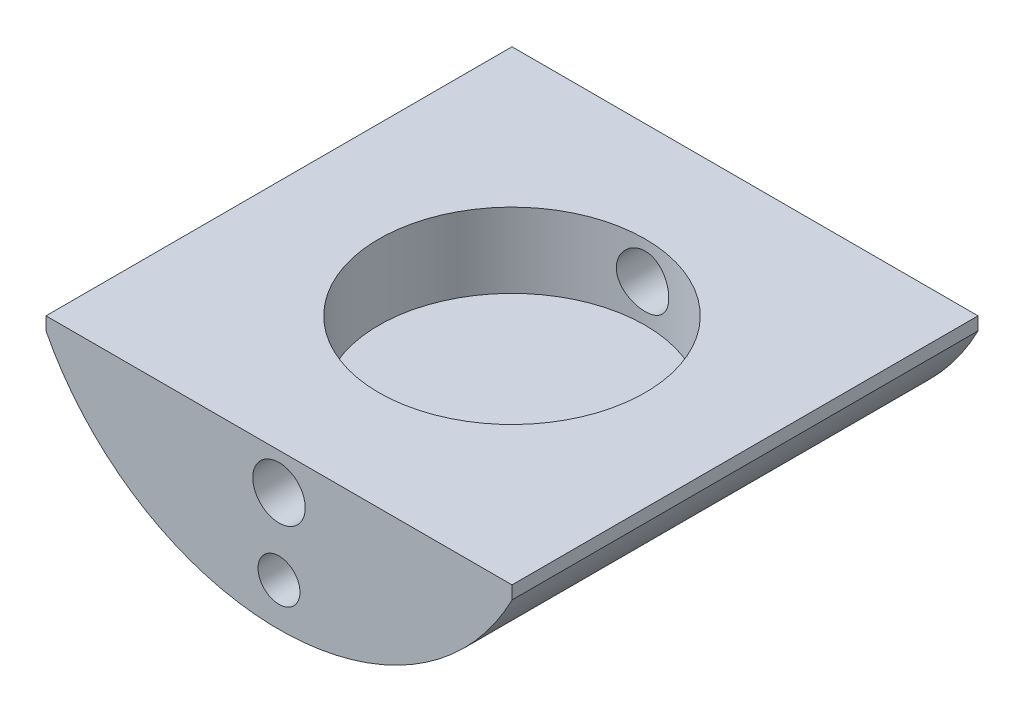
from build123d import *

# Parameters (mm, degrees)
BOSS_EXTRUDE1_DEPTH          = 44.45
SKETCH2_R                    = 25.4
CUT_EXTRUDE1_DEPTH           = 14.25
F_10_0_10_DIAMETER_HOLE1_D   = 10
F_8_0_8_DIAMETER_HOLE1_D     = 8
F_8_0_8_DIAMETER_HOLE1_DEPTH = 17.5


with BuildPart() as part:
    # Sketch1 → Boss-Extrude1 (new, symmetric)
    with BuildSketch(Plane.XY):
        with BuildLine():
            Line((-44.45, -2.5), (-44.45, 0))
            Line((-44.45, 0), (44.45, 0))
            Line((44.45, 0), (44.45, -2.5))
            ThreePointArc((44.45, -2.5), (0, -29.604640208), (-44.45, -2.5))
        make_face()
    extrude(amount=BOSS_EXTRUDE1_DEPTH, both=True)

    # Sketch2 → Cut-Extrude1 (cut)
    with BuildSketch(Plane(origin=(0, 0, 0), x_dir=(1, 0, 0), z_dir=(0, 1, 0))):
        with Locations(Location((0, 0, 0), (0, 0, 270))):
            Circle(SKETCH2_R)
    extrude(amount=-CUT_EXTRUDE1_DEPTH, mode=Mode.SUBTRACT)

    # 10.0 _10_ Diameter Hole1 (through all)
    with Locations(Plane.XY.offset(44.45)):
        with Locations((0, -7)):
            Hole(F_10_0_10_DIAMETER_HOLE1_D / 2)

    # 8.0 _8_ Diameter Hole1
    with Locations(Plane.XY.offset(44.45)):
        with Locations((0, -21.45)):
            f_8_0_8_diameter_hole1 = Hole(F_8_0_8_DIAMETER_HOLE1_D / 2, depth=F_8_0_8_DIAMETER_HOLE1_DEPTH)

    # Mirror1: 8.0 _8_ Diameter Hole1 across plane
    add(f_8_0_8_diameter_hole1.mirror(Plane.XY), mode=Mode.SUBTRACT)


solid = part.part
